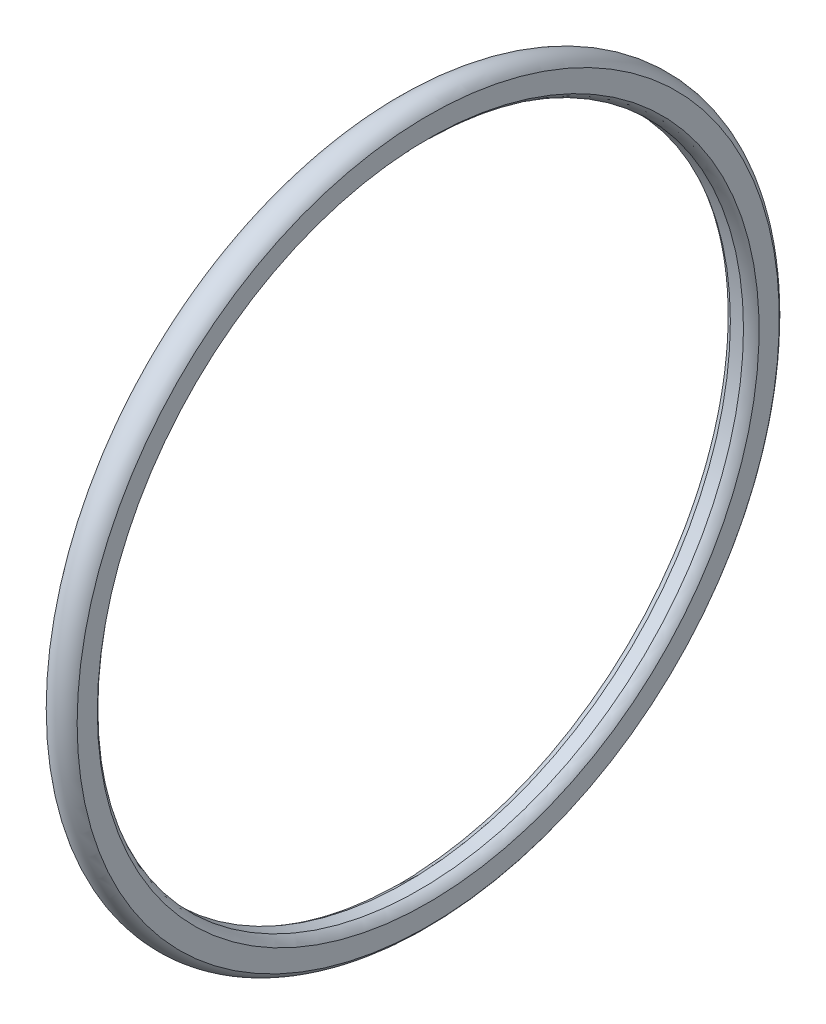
from build123d import *


with BuildPart() as part:
    # Esquisse1 → Base-R_volution (revolve)
    with BuildSketch(Plane.XY, mode=Mode.PRIVATE) as base_r_volution_sk:
        with BuildLine():
            Line((-7.5, 57.658312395), (-7.5, 54.341687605))
            ThreePointArc((-7.5, 54.341687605), (-8.122593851, 53.660054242), (-8.922967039, 53.2))
            Line((-8.922967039, 53.2), (-10, 53.2))
            Line((-10, 53.2), (-11.077032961, 53.2))
            ThreePointArc((-11.077032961, 53.2), (-12.339945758, 57.877406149), (-7.5, 57.658312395))
        make_face()
    revolve(base_r_volution_sk.sketch.rotate(Axis((-50, 0, 0), (1, 0, 0)), 90), axis=Axis((-50, 0, 0), (1, 0, 0)))


solid = part.part
